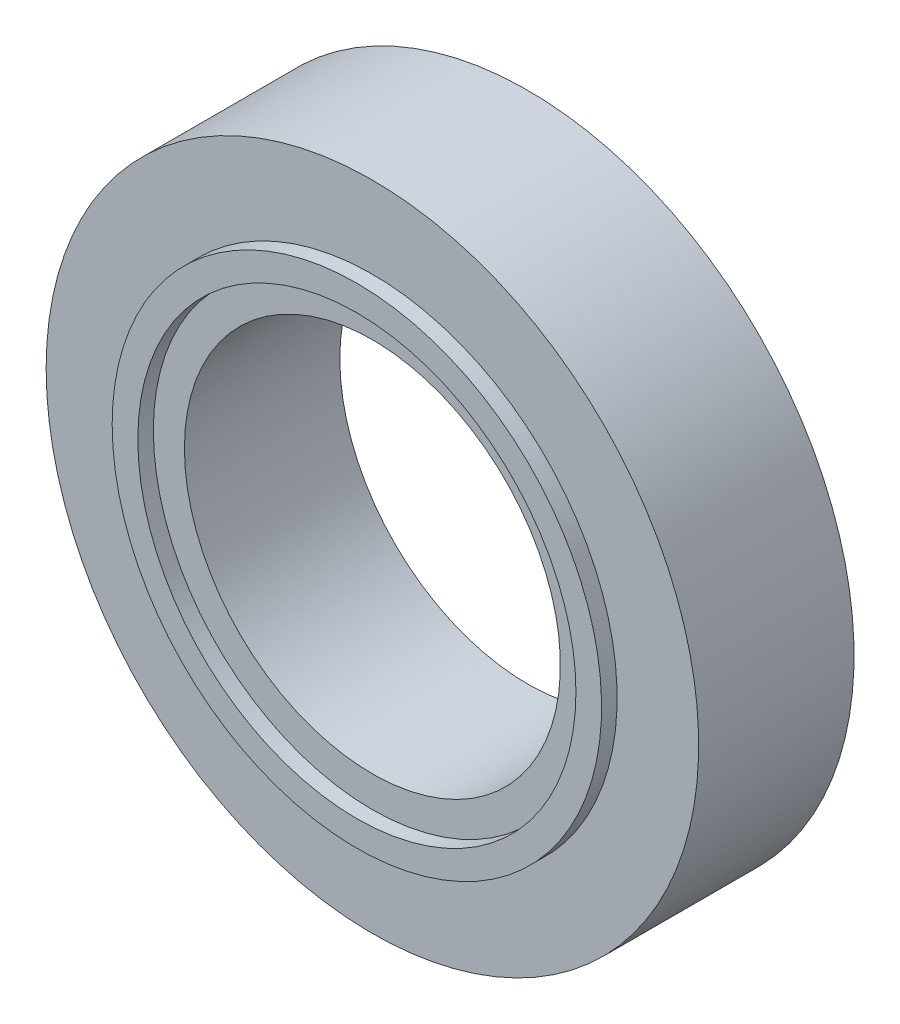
ISO-10303-21;
HEADER;
FILE_DESCRIPTION(('STEP AP214'),'2;1');
FILE_NAME('part.step','',(''),(''),'','','');
FILE_SCHEMA(('AUTOMOTIVE_DESIGN { 1 0 10303 214 1 1 1 1 }'));
ENDSEC;
DATA;
#1=APPLICATION_CONTEXT('core data for automotive mechanical design processes');
#2=APPLICATION_PROTOCOL_DEFINITION('international standard','automotive_design',2000,#1);
#3=PRODUCT_CONTEXT('',#1,'mechanical');
#4=PRODUCT('Part','Part','',(#3));
#5=PRODUCT_RELATED_PRODUCT_CATEGORY('part','',(#4));
#6=PRODUCT_DEFINITION_FORMATION('','',#4);
#7=PRODUCT_DEFINITION_CONTEXT('part definition',#1,'design');
#8=PRODUCT_DEFINITION('design','',#6,#7);
#9=PRODUCT_DEFINITION_SHAPE('','',#8);
#10=(LENGTH_UNIT() NAMED_UNIT(*) SI_UNIT(.MILLI.,.METRE.));
#11=(NAMED_UNIT(*) PLANE_ANGLE_UNIT() SI_UNIT($,.RADIAN.));
#12=(NAMED_UNIT(*) SI_UNIT($,.STERADIAN.) SOLID_ANGLE_UNIT());
#13=UNCERTAINTY_MEASURE_WITH_UNIT(LENGTH_MEASURE(1.E-05),#10,'distance_accuracy_value','');
#14=(GEOMETRIC_REPRESENTATION_CONTEXT(3) GLOBAL_UNCERTAINTY_ASSIGNED_CONTEXT((#13)) GLOBAL_UNIT_ASSIGNED_CONTEXT((#10,
#11,#12)) REPRESENTATION_CONTEXT('',''));
#15=CARTESIAN_POINT('',(0.,0.,0.));
#16=DIRECTION('',(0.,0.,1.));
#17=DIRECTION('',(1.,0.,0.));
#18=AXIS2_PLACEMENT_3D('',#15,#16,#17);
#19=CARTESIAN_POINT('',(0.,0.,-40.));
#20=DIRECTION('',(0.,0.,-1.));
#21=DIRECTION('',(-1.,0.,0.));
#22=AXIS2_PLACEMENT_3D('',#19,#20,#21);
#23=PLANE('',#22);
#24=CARTESIAN_POINT('',(0.,0.,-40.));
#25=DIRECTION('',(0.,0.,-1.));
#26=DIRECTION('',(-1.,0.,0.));
#27=AXIS2_PLACEMENT_3D('',#24,#25,#26);
#28=CIRCLE('',#27,12.1);
#29=CARTESIAN_POINT('',(-12.1,0.,-40.));
#30=VERTEX_POINT('',#29);
#31=EDGE_CURVE('E48',#30,#30,#28,.T.);
#32=ORIENTED_EDGE('',*,*,#31,.T.);
#33=EDGE_LOOP('',(#32));
#34=FACE_BOUND('',#33,.T.);
#35=CARTESIAN_POINT('',(0.,0.,-40.));
#36=DIRECTION('',(0.,0.,1.));
#37=DIRECTION('',(1.,0.,0.));
#38=AXIS2_PLACEMENT_3D('',#35,#36,#37);
#39=CIRCLE('',#38,14.1);
#40=CARTESIAN_POINT('',(14.1,0.,-40.));
#41=VERTEX_POINT('',#40);
#42=EDGE_CURVE('E73',#41,#41,#39,.T.);
#43=ORIENTED_EDGE('',*,*,#42,.T.);
#44=EDGE_LOOP('',(#43));
#45=FACE_BOUND('',#44,.T.);
#46=ADVANCED_FACE('F32',(#34,#45),#23,.F.);
#47=CARTESIAN_POINT('',(0.,0.,-40.));
#48=DIRECTION('',(0.,0.,-1.));
#49=DIRECTION('',(-1.,0.,0.));
#50=AXIS2_PLACEMENT_3D('',#47,#48,#49);
#51=CYLINDRICAL_SURFACE('',#50,21.);
#52=CARTESIAN_POINT('',(0.,0.,-40.));
#53=DIRECTION('',(0.,0.,-1.));
#54=DIRECTION('',(-1.,0.,0.));
#55=AXIS2_PLACEMENT_3D('',#52,#53,#54);
#56=CIRCLE('',#55,21.);
#57=CARTESIAN_POINT('',(-21.,0.,-40.));
#58=VERTEX_POINT('',#57);
#59=EDGE_CURVE('E39',#58,#58,#56,.T.);
#60=ORIENTED_EDGE('',*,*,#59,.T.);
#61=EDGE_LOOP('',(#60));
#62=FACE_BOUND('',#61,.T.);
#63=CARTESIAN_POINT('',(0.,0.,-50.));
#64=DIRECTION('',(0.,0.,-1.));
#65=DIRECTION('',(-1.,0.,0.));
#66=AXIS2_PLACEMENT_3D('',#63,#64,#65);
#67=CIRCLE('',#66,21.);
#68=CARTESIAN_POINT('',(-21.,0.,-50.));
#69=VERTEX_POINT('',#68);
#70=EDGE_CURVE('E43',#69,#69,#67,.T.);
#71=ORIENTED_EDGE('',*,*,#70,.F.);
#72=EDGE_LOOP('',(#71));
#73=FACE_BOUND('',#72,.T.);
#74=ADVANCED_FACE('F34',(#62,#73),#51,.T.);
#75=CARTESIAN_POINT('',(0.,0.,-40.));
#76=DIRECTION('',(0.,0.,-1.));
#77=DIRECTION('',(-1.,0.,0.));
#78=AXIS2_PLACEMENT_3D('',#75,#76,#77);
#79=CIRCLE('',#78,15.75);
#80=CARTESIAN_POINT('',(-15.75,0.,-40.));
#81=VERTEX_POINT('',#80);
#82=EDGE_CURVE('E10',#81,#81,#79,.F.);
#83=ORIENTED_EDGE('',*,*,#82,.F.);
#84=EDGE_LOOP('',(#83));
#85=FACE_BOUND('',#84,.T.);
#86=ORIENTED_EDGE('',*,*,#59,.F.);
#87=EDGE_LOOP('',(#86));
#88=FACE_BOUND('',#87,.T.);
#89=ADVANCED_FACE('F97',(#85,#88),#23,.F.);
#90=CARTESIAN_POINT('',(0.,0.,-50.));
#91=DIRECTION('',(0.,0.,-1.));
#92=DIRECTION('',(-1.,0.,0.));
#93=AXIS2_PLACEMENT_3D('',#90,#91,#92);
#94=PLANE('',#93);
#95=CARTESIAN_POINT('',(0.,-16.5,-50.));
#96=DIRECTION('',(0.,0.,-1.));
#97=DIRECTION('',(-1.,0.,0.));
#98=AXIS2_PLACEMENT_3D('',#95,#96,#97);
#99=CIRCLE('',#98,1.5);
#100=CARTESIAN_POINT('',(-1.5,-16.5,-50.));
#101=VERTEX_POINT('',#100);
#102=EDGE_CURVE('E63',#101,#101,#99,.T.);
#103=ORIENTED_EDGE('',*,*,#102,.F.);
#104=EDGE_LOOP('',(#103));
#105=FACE_BOUND('',#104,.T.);
#106=CARTESIAN_POINT('',(0.,16.5,-50.));
#107=DIRECTION('',(0.,0.,-1.));
#108=DIRECTION('',(-1.,0.,0.));
#109=AXIS2_PLACEMENT_3D('',#106,#107,#108);
#110=CIRCLE('',#109,1.5);
#111=CARTESIAN_POINT('',(-1.5,16.5,-50.));
#112=VERTEX_POINT('',#111);
#113=EDGE_CURVE('E59',#112,#112,#110,.T.);
#114=ORIENTED_EDGE('',*,*,#113,.F.);
#115=EDGE_LOOP('',(#114));
#116=FACE_BOUND('',#115,.T.);
#117=CARTESIAN_POINT('',(0.,0.,-50.));
#118=DIRECTION('',(0.,0.,-1.));
#119=DIRECTION('',(-1.,0.,0.));
#120=AXIS2_PLACEMENT_3D('',#117,#118,#119);
#121=CIRCLE('',#120,12.1);
#122=CARTESIAN_POINT('',(-12.1,0.,-50.));
#123=VERTEX_POINT('',#122);
#124=EDGE_CURVE('E50',#123,#123,#121,.T.);
#125=ORIENTED_EDGE('',*,*,#124,.F.);
#126=EDGE_LOOP('',(#125));
#127=FACE_BOUND('',#126,.T.);
#128=ORIENTED_EDGE('',*,*,#70,.T.);
#129=EDGE_LOOP('',(#128));
#130=FACE_BOUND('',#129,.T.);
#131=ADVANCED_FACE('F103',(#105,#116,#127,#130),#94,.T.);
#132=CARTESIAN_POINT('',(0.,0.,-40.));
#133=DIRECTION('',(0.,0.,-1.));
#134=DIRECTION('',(-1.,0.,0.));
#135=AXIS2_PLACEMENT_3D('',#132,#133,#134);
#136=CYLINDRICAL_SURFACE('',#135,12.1);
#137=ORIENTED_EDGE('',*,*,#31,.F.);
#138=EDGE_LOOP('',(#137));
#139=FACE_BOUND('',#138,.T.);
#140=ORIENTED_EDGE('',*,*,#124,.T.);
#141=EDGE_LOOP('',(#140));
#142=FACE_BOUND('',#141,.T.);
#143=ADVANCED_FACE('F108',(#139,#142),#136,.F.);
#144=CARTESIAN_POINT('',(0.,16.5,-45.));
#145=DIRECTION('',(0.,0.,-1.));
#146=DIRECTION('',(-1.,0.,0.));
#147=AXIS2_PLACEMENT_3D('',#144,#145,#146);
#148=CYLINDRICAL_SURFACE('',#147,1.5);
#149=CARTESIAN_POINT('',(0.,16.5,-45.));
#150=DIRECTION('',(0.,0.,-1.));
#151=DIRECTION('',(-1.,0.,0.));
#152=AXIS2_PLACEMENT_3D('',#149,#150,#151);
#153=CIRCLE('',#152,1.5);
#154=CARTESIAN_POINT('',(-1.5,16.5,-45.));
#155=VERTEX_POINT('',#154);
#156=EDGE_CURVE('E56',#155,#155,#153,.T.);
#157=ORIENTED_EDGE('',*,*,#156,.F.);
#158=EDGE_LOOP('',(#157));
#159=FACE_BOUND('',#158,.T.);
#160=ORIENTED_EDGE('',*,*,#113,.T.);
#161=EDGE_LOOP('',(#160));
#162=FACE_BOUND('',#161,.T.);
#163=ADVANCED_FACE('F114',(#159,#162),#148,.F.);
#164=CARTESIAN_POINT('',(0.,16.5,-45.));
#165=DIRECTION('',(0.,0.,-1.));
#166=DIRECTION('',(-1.,0.,0.));
#167=AXIS2_PLACEMENT_3D('',#164,#165,#166);
#168=PLANE('',#167);
#169=ORIENTED_EDGE('',*,*,#156,.T.);
#170=EDGE_LOOP('',(#169));
#171=FACE_BOUND('',#170,.T.);
#172=ADVANCED_FACE('F127',(#171),#168,.T.);
#173=CARTESIAN_POINT('',(0.,-16.5,-45.));
#174=DIRECTION('',(0.,0.,-1.));
#175=DIRECTION('',(-1.,0.,0.));
#176=AXIS2_PLACEMENT_3D('',#173,#174,#175);
#177=CYLINDRICAL_SURFACE('',#176,1.5);
#178=CARTESIAN_POINT('',(0.,-16.5,-45.));
#179=DIRECTION('',(0.,0.,-1.));
#180=DIRECTION('',(-1.,0.,0.));
#181=AXIS2_PLACEMENT_3D('',#178,#179,#180);
#182=CIRCLE('',#181,1.5);
#183=CARTESIAN_POINT('',(-1.5,-16.5,-45.));
#184=VERTEX_POINT('',#183);
#185=EDGE_CURVE('E53',#184,#184,#182,.T.);
#186=ORIENTED_EDGE('',*,*,#185,.F.);
#187=EDGE_LOOP('',(#186));
#188=FACE_BOUND('',#187,.T.);
#189=ORIENTED_EDGE('',*,*,#102,.T.);
#190=EDGE_LOOP('',(#189));
#191=FACE_BOUND('',#190,.T.);
#192=ADVANCED_FACE('F133',(#188,#191),#177,.F.);
#193=CARTESIAN_POINT('',(0.,-16.5,-45.));
#194=DIRECTION('',(0.,0.,-1.));
#195=DIRECTION('',(-1.,0.,0.));
#196=AXIS2_PLACEMENT_3D('',#193,#194,#195);
#197=PLANE('',#196);
#198=ORIENTED_EDGE('',*,*,#185,.T.);
#199=EDGE_LOOP('',(#198));
#200=FACE_BOUND('',#199,.T.);
#201=ADVANCED_FACE('F90',(#200),#197,.T.);
#202=CARTESIAN_POINT('',(0.,0.,5.54772721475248));
#203=DIRECTION('',(0.,0.,-1.));
#204=DIRECTION('',(-1.,0.,0.));
#205=AXIS2_PLACEMENT_3D('',#202,#203,#204);
#206=CYLINDRICAL_SURFACE('',#205,15.75);
#207=CARTESIAN_POINT('',(0.,0.,-39.));
#208=DIRECTION('',(0.,0.,-1.));
#209=DIRECTION('',(0.,1.,0.));
#210=AXIS2_PLACEMENT_3D('',#207,#208,#209);
#211=CIRCLE('',#210,15.75);
#212=CARTESIAN_POINT('',(0.,15.75,-39.));
#213=VERTEX_POINT('',#212);
#214=EDGE_CURVE('E70',#213,#213,#211,.T.);
#215=ORIENTED_EDGE('',*,*,#214,.T.);
#216=EDGE_LOOP('',(#215));
#217=FACE_BOUND('',#216,.T.);
#218=ORIENTED_EDGE('',*,*,#82,.T.);
#219=EDGE_LOOP('',(#218));
#220=FACE_BOUND('',#219,.T.);
#221=ADVANCED_FACE('F81',(#217,#220),#206,.T.);
#222=CARTESIAN_POINT('',(0.,0.,5.54772721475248));
#223=DIRECTION('',(0.,0.,-1.));
#224=DIRECTION('',(-1.,0.,0.));
#225=AXIS2_PLACEMENT_3D('',#222,#223,#224);
#226=CYLINDRICAL_SURFACE('',#225,14.1);
#227=CARTESIAN_POINT('',(0.,0.,-39.));
#228=DIRECTION('',(0.,0.,-1.));
#229=DIRECTION('',(0.,1.,0.));
#230=AXIS2_PLACEMENT_3D('',#227,#228,#229);
#231=CIRCLE('',#230,14.1);
#232=CARTESIAN_POINT('',(0.,14.1,-39.));
#233=VERTEX_POINT('',#232);
#234=EDGE_CURVE('E60',#233,#233,#231,.T.);
#235=ORIENTED_EDGE('',*,*,#234,.F.);
#236=EDGE_LOOP('',(#235));
#237=FACE_BOUND('',#236,.T.);
#238=ORIENTED_EDGE('',*,*,#42,.F.);
#239=EDGE_LOOP('',(#238));
#240=FACE_BOUND('',#239,.T.);
#241=ADVANCED_FACE('F78',(#237,#240),#226,.F.);
#242=CARTESIAN_POINT('',(0.,0.,-39.));
#243=DIRECTION('',(0.,0.,-1.));
#244=DIRECTION('',(0.,1.,0.));
#245=AXIS2_PLACEMENT_3D('',#242,#243,#244);
#246=PLANE('',#245);
#247=ORIENTED_EDGE('',*,*,#234,.T.);
#248=EDGE_LOOP('',(#247));
#249=FACE_BOUND('',#248,.T.);
#250=ORIENTED_EDGE('',*,*,#214,.F.);
#251=EDGE_LOOP('',(#250));
#252=FACE_BOUND('',#251,.T.);
#253=ADVANCED_FACE('F80',(#249,#252),#246,.F.);
#254=CLOSED_SHELL('',(#46,#74,#89,#131,#143,#163,#172,#192,#201,#221,#241,#253));
#255=MANIFOLD_SOLID_BREP('B2',#254);
#256=ADVANCED_BREP_SHAPE_REPRESENTATION('',(#18,#255),#14);
#257=SHAPE_DEFINITION_REPRESENTATION(#9,#256);
ENDSEC;
END-ISO-10303-21;
